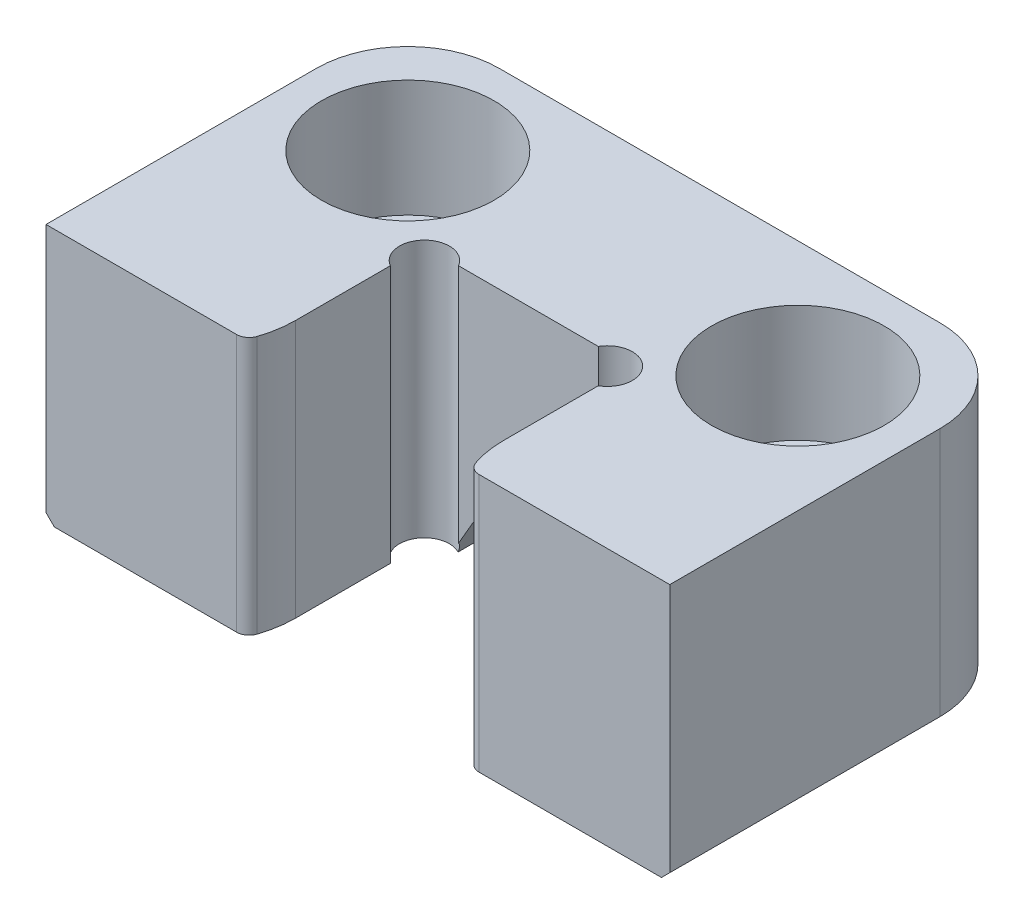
ISO-10303-21;
HEADER;
FILE_DESCRIPTION(('STEP AP214'),'2;1');
FILE_NAME('part.step','',(''),(''),'','','');
FILE_SCHEMA(('AUTOMOTIVE_DESIGN { 1 0 10303 214 1 1 1 1 }'));
ENDSEC;
DATA;
#1=APPLICATION_CONTEXT('core data for automotive mechanical design processes');
#2=APPLICATION_PROTOCOL_DEFINITION('international standard','automotive_design',2000,#1);
#3=PRODUCT_CONTEXT('',#1,'mechanical');
#4=PRODUCT('Part','Part','',(#3));
#5=PRODUCT_RELATED_PRODUCT_CATEGORY('part','',(#4));
#6=PRODUCT_DEFINITION_FORMATION('','',#4);
#7=PRODUCT_DEFINITION_CONTEXT('part definition',#1,'design');
#8=PRODUCT_DEFINITION('design','',#6,#7);
#9=PRODUCT_DEFINITION_SHAPE('','',#8);
#10=(LENGTH_UNIT() NAMED_UNIT(*) SI_UNIT(.MILLI.,.METRE.));
#11=(NAMED_UNIT(*) PLANE_ANGLE_UNIT() SI_UNIT($,.RADIAN.));
#12=(NAMED_UNIT(*) SI_UNIT($,.STERADIAN.) SOLID_ANGLE_UNIT());
#13=UNCERTAINTY_MEASURE_WITH_UNIT(LENGTH_MEASURE(1.E-05),#10,'distance_accuracy_value','');
#14=(GEOMETRIC_REPRESENTATION_CONTEXT(3) GLOBAL_UNCERTAINTY_ASSIGNED_CONTEXT((#13)) GLOBAL_UNIT_ASSIGNED_CONTEXT((#10,
#11,#12)) REPRESENTATION_CONTEXT('',''));
#15=CARTESIAN_POINT('',(0.,0.,0.));
#16=DIRECTION('',(0.,0.,1.));
#17=DIRECTION('',(1.,0.,0.));
#18=AXIS2_PLACEMENT_3D('',#15,#16,#17);
#19=CARTESIAN_POINT('',(-19.05,-15.748,-22.098));
#20=DIRECTION('',(0.,-1.,0.));
#21=DIRECTION('',(0.,0.,-1.));
#22=AXIS2_PLACEMENT_3D('',#19,#20,#21);
#23=PLANE('',#22);
#24=CARTESIAN_POINT('',(-11.9126,-15.748,-14.9606));
#25=DIRECTION('',(0.,1.,0.));
#26=DIRECTION('',(0.,0.,1.));
#27=AXIS2_PLACEMENT_3D('',#24,#25,#26);
#28=CIRCLE('',#27,3.2639);
#29=CARTESIAN_POINT('',(-11.9126,-15.748,-11.6967));
#30=VERTEX_POINT('',#29);
#31=EDGE_CURVE('E763',#30,#30,#28,.T.);
#32=ORIENTED_EDGE('',*,*,#31,.T.);
#33=EDGE_LOOP('',(#32));
#34=FACE_BOUND('',#33,.T.);
#35=CARTESIAN_POINT('',(-12.7,-15.748,-2.54));
#36=DIRECTION('',(0.,-1.,0.));
#37=DIRECTION('',(0.,0.,1.));
#38=AXIS2_PLACEMENT_3D('',#35,#36,#37);
#39=CIRCLE('',#38,6.35);
#40=CARTESIAN_POINT('',(-6.35,-15.748,-2.54));
#41=VERTEX_POINT('',#40);
#42=CARTESIAN_POINT('',(-6.68001134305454,-15.748,-0.519545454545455));
#43=VERTEX_POINT('',#42);
#44=EDGE_CURVE('E261',#41,#43,#39,.T.);
#45=ORIENTED_EDGE('',*,*,#44,.T.);
#46=CARTESIAN_POINT('',(-7.402409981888,-15.748,-0.762));
#47=DIRECTION('',(0.,-1.,0.));
#48=DIRECTION('',(0.,0.,-1.));
#49=AXIS2_PLACEMENT_3D('',#46,#47,#48);
#50=CIRCLE('',#49,0.762);
#51=CARTESIAN_POINT('',(-7.402409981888,-15.748,0.));
#52=VERTEX_POINT('',#51);
#53=EDGE_CURVE('E11',#43,#52,#50,.T.);
#54=ORIENTED_EDGE('',*,*,#53,.T.);
#55=DIRECTION('',(1.,0.,0.));
#56=VECTOR('',#55,1.);
#57=CARTESIAN_POINT('',(-19.05,-15.748,0.));
#58=LINE('',#57,#56);
#59=CARTESIAN_POINT('',(-18.542,-15.748,0.));
#60=VERTEX_POINT('',#59);
#61=EDGE_CURVE('E274',#60,#52,#58,.T.);
#62=ORIENTED_EDGE('',*,*,#61,.F.);
#63=DIRECTION('',(0.,0.,-1.));
#64=VECTOR('',#63,1.);
#65=CARTESIAN_POINT('',(-18.542,-15.748,-22.098));
#66=LINE('',#65,#64);
#67=CARTESIAN_POINT('',(-18.542,-15.748,-16.51));
#68=VERTEX_POINT('',#67);
#69=EDGE_CURVE('E353',#60,#68,#66,.T.);
#70=ORIENTED_EDGE('',*,*,#69,.T.);
#71=CARTESIAN_POINT('',(-13.462,-15.748,-16.51));
#72=DIRECTION('',(0.,-1.,0.));
#73=DIRECTION('',(0.,0.,-1.));
#74=AXIS2_PLACEMENT_3D('',#71,#72,#73);
#75=CIRCLE('',#74,5.08);
#76=CARTESIAN_POINT('',(-13.462,-15.748,-21.59));
#77=VERTEX_POINT('',#76);
#78=EDGE_CURVE('E355',#68,#77,#75,.T.);
#79=ORIENTED_EDGE('',*,*,#78,.T.);
#80=DIRECTION('',(1.,0.,0.));
#81=VECTOR('',#80,1.);
#82=CARTESIAN_POINT('',(-19.05,-15.748,-21.59));
#83=LINE('',#82,#81);
#84=CARTESIAN_POINT('',(-4.88529355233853,-15.748,-21.59));
#85=VERTEX_POINT('',#84);
#86=EDGE_CURVE('E357',#77,#85,#83,.T.);
#87=ORIENTED_EDGE('',*,*,#86,.T.);
#88=DIRECTION('',(0.,0.,-1.));
#89=VECTOR('',#88,1.);
#90=CARTESIAN_POINT('',(-4.88529355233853,-15.748,0.));
#91=LINE('',#90,#89);
#92=CARTESIAN_POINT('',(-4.88529355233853,-15.748,-11.0043237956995));
#93=VERTEX_POINT('',#92);
#94=EDGE_CURVE('E233',#93,#85,#91,.T.);
#95=ORIENTED_EDGE('',*,*,#94,.F.);
#96=CARTESIAN_POINT('',(-5.588,-15.748,-9.652));
#97=DIRECTION('',(0.,1.,0.));
#98=DIRECTION('',(0.,0.,1.));
#99=AXIS2_PLACEMENT_3D('',#96,#97,#98);
#100=CIRCLE('',#99,1.524);
#101=CARTESIAN_POINT('',(-6.35,-15.748,-8.33217728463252));
#102=VERTEX_POINT('',#101);
#103=EDGE_CURVE('E252',#93,#102,#100,.T.);
#104=ORIENTED_EDGE('',*,*,#103,.T.);
#105=DIRECTION('',(0.,0.,-1.));
#106=VECTOR('',#105,1.);
#107=CARTESIAN_POINT('',(-6.35,-15.748,0.));
#108=LINE('',#107,#106);
#109=EDGE_CURVE('E276',#41,#102,#108,.T.);
#110=ORIENTED_EDGE('',*,*,#109,.F.);
#111=EDGE_LOOP('',(#45,#54,#62,#70,#79,#87,#95,#104,#110));
#112=FACE_BOUND('',#111,.T.);
#113=ADVANCED_FACE('F34',(#34,#112),#23,.T.);
#114=CARTESIAN_POINT('',(-19.05,-15.748,0.));
#115=DIRECTION('',(-1.,0.,0.));
#116=DIRECTION('',(0.,0.,1.));
#117=AXIS2_PLACEMENT_3D('',#114,#115,#116);
#118=PLANE('',#117);
#119=DIRECTION('',(0.,1.,0.));
#120=VECTOR('',#119,1.);
#121=CARTESIAN_POINT('',(-19.05,-15.748,-16.51));
#122=LINE('',#121,#120);
#123=CARTESIAN_POINT('',(-19.05,0.,-16.51));
#124=VERTEX_POINT('',#123);
#125=CARTESIAN_POINT('',(-19.05,-15.24,-16.51));
#126=VERTEX_POINT('',#125);
#127=EDGE_CURVE('E321',#124,#126,#122,.F.);
#128=ORIENTED_EDGE('',*,*,#127,.T.);
#129=DIRECTION('',(0.,0.,1.));
#130=VECTOR('',#129,1.);
#131=CARTESIAN_POINT('',(-19.05,-15.24,0.));
#132=LINE('',#131,#130);
#133=CARTESIAN_POINT('',(-19.05,-15.24,0.));
#134=VERTEX_POINT('',#133);
#135=EDGE_CURVE('E362',#126,#134,#132,.T.);
#136=ORIENTED_EDGE('',*,*,#135,.T.);
#137=DIRECTION('',(0.,1.,0.));
#138=VECTOR('',#137,1.);
#139=CARTESIAN_POINT('',(-19.05,-15.748,0.));
#140=LINE('',#139,#138);
#141=CARTESIAN_POINT('',(-19.05,0.,0.));
#142=VERTEX_POINT('',#141);
#143=EDGE_CURVE('E285',#134,#142,#140,.T.);
#144=ORIENTED_EDGE('',*,*,#143,.T.);
#145=DIRECTION('',(0.,0.,1.));
#146=VECTOR('',#145,1.);
#147=CARTESIAN_POINT('',(-19.05,0.,0.));
#148=LINE('',#147,#146);
#149=EDGE_CURVE('E271',#124,#142,#148,.T.);
#150=ORIENTED_EDGE('',*,*,#149,.F.);
#151=EDGE_LOOP('',(#128,#136,#144,#150));
#152=FACE_BOUND('',#151,.T.);
#153=ADVANCED_FACE('F411',(#152),#118,.T.);
#154=CARTESIAN_POINT('',(-19.05,-15.748,-22.098));
#155=DIRECTION('',(0.,0.,-1.));
#156=DIRECTION('',(-1.,0.,0.));
#157=AXIS2_PLACEMENT_3D('',#154,#155,#156);
#158=PLANE('',#157);
#159=DIRECTION('',(0.,1.,0.));
#160=VECTOR('',#159,1.);
#161=CARTESIAN_POINT('',(13.462,-15.748,-22.098));
#162=LINE('',#161,#160);
#163=CARTESIAN_POINT('',(13.462,0.,-22.098));
#164=VERTEX_POINT('',#163);
#165=CARTESIAN_POINT('',(13.462,-15.24,-22.098));
#166=VERTEX_POINT('',#165);
#167=EDGE_CURVE('E319',#164,#166,#162,.F.);
#168=ORIENTED_EDGE('',*,*,#167,.T.);
#169=DIRECTION('',(-1.,0.,0.));
#170=VECTOR('',#169,1.);
#171=CARTESIAN_POINT('',(-19.05,-15.24,-22.098));
#172=LINE('',#171,#170);
#173=CARTESIAN_POINT('',(4.5919996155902,-15.24,-22.098));
#174=VERTEX_POINT('',#173);
#175=EDGE_CURVE('E349',#166,#174,#172,.T.);
#176=ORIENTED_EDGE('',*,*,#175,.T.);
#177=DIRECTION('',(0.499999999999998,-0.86602540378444,0.));
#178=VECTOR('',#177,1.);
#179=CARTESIAN_POINT('',(3.96875,-14.1605,-22.098));
#180=LINE('',#179,#178);
#181=CARTESIAN_POINT('',(3.96875,-14.1605,-22.098));
#182=VERTEX_POINT('',#181);
#183=EDGE_CURVE('E213',#182,#174,#180,.T.);
#184=ORIENTED_EDGE('',*,*,#183,.F.);
#185=DIRECTION('',(1.,0.,0.));
#186=VECTOR('',#185,1.);
#187=CARTESIAN_POINT('',(3.96875,-14.1605,-22.098));
#188=LINE('',#187,#186);
#189=CARTESIAN_POINT('',(-3.96875,-14.1605,-22.098));
#190=VERTEX_POINT('',#189);
#191=EDGE_CURVE('E206',#190,#182,#188,.T.);
#192=ORIENTED_EDGE('',*,*,#191,.F.);
#193=DIRECTION('',(0.499999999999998,0.86602540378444,0.));
#194=VECTOR('',#193,1.);
#195=CARTESIAN_POINT('',(-3.96875,-14.1605,-22.098));
#196=LINE('',#195,#194);
#197=CARTESIAN_POINT('',(-4.5919996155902,-15.24,-22.098));
#198=VERTEX_POINT('',#197);
#199=EDGE_CURVE('E216',#198,#190,#196,.T.);
#200=ORIENTED_EDGE('',*,*,#199,.F.);
#201=DIRECTION('',(-1.,0.,0.));
#202=VECTOR('',#201,1.);
#203=CARTESIAN_POINT('',(-19.05,-15.24,-22.098));
#204=LINE('',#203,#202);
#205=CARTESIAN_POINT('',(-13.462,-15.24,-22.098));
#206=VERTEX_POINT('',#205);
#207=EDGE_CURVE('E347',#198,#206,#204,.T.);
#208=ORIENTED_EDGE('',*,*,#207,.T.);
#209=DIRECTION('',(0.,1.,0.));
#210=VECTOR('',#209,1.);
#211=CARTESIAN_POINT('',(-13.462,-15.748,-22.098));
#212=LINE('',#211,#210);
#213=CARTESIAN_POINT('',(-13.462,0.,-22.098));
#214=VERTEX_POINT('',#213);
#215=EDGE_CURVE('E317',#206,#214,#212,.T.);
#216=ORIENTED_EDGE('',*,*,#215,.T.);
#217=DIRECTION('',(-1.,0.,0.));
#218=VECTOR('',#217,1.);
#219=CARTESIAN_POINT('',(-19.05,0.,-22.098));
#220=LINE('',#219,#218);
#221=EDGE_CURVE('E277',#164,#214,#220,.T.);
#222=ORIENTED_EDGE('',*,*,#221,.F.);
#223=EDGE_LOOP('',(#168,#176,#184,#192,#200,#208,#216,#222));
#224=FACE_BOUND('',#223,.T.);
#225=ADVANCED_FACE('F227',(#224),#158,.T.);
#226=CARTESIAN_POINT('',(19.05,-15.748,0.));
#227=DIRECTION('',(1.,0.,0.));
#228=DIRECTION('',(0.,0.,-1.));
#229=AXIS2_PLACEMENT_3D('',#226,#227,#228);
#230=PLANE('',#229);
#231=DIRECTION('',(0.,1.,0.));
#232=VECTOR('',#231,1.);
#233=CARTESIAN_POINT('',(19.05,-15.748,0.));
#234=LINE('',#233,#232);
#235=CARTESIAN_POINT('',(19.05,-15.24,0.));
#236=VERTEX_POINT('',#235);
#237=CARTESIAN_POINT('',(19.05,0.,0.));
#238=VERTEX_POINT('',#237);
#239=EDGE_CURVE('E307',#236,#238,#234,.T.);
#240=ORIENTED_EDGE('',*,*,#239,.F.);
#241=DIRECTION('',(0.,0.,-1.));
#242=VECTOR('',#241,1.);
#243=CARTESIAN_POINT('',(19.05,-15.24,0.));
#244=LINE('',#243,#242);
#245=CARTESIAN_POINT('',(19.05,-15.24,-16.51));
#246=VERTEX_POINT('',#245);
#247=EDGE_CURVE('E333',#236,#246,#244,.T.);
#248=ORIENTED_EDGE('',*,*,#247,.T.);
#249=DIRECTION('',(0.,1.,0.));
#250=VECTOR('',#249,1.);
#251=CARTESIAN_POINT('',(19.05,-15.748,-16.51));
#252=LINE('',#251,#250);
#253=CARTESIAN_POINT('',(19.05,0.,-16.51));
#254=VERTEX_POINT('',#253);
#255=EDGE_CURVE('E310',#246,#254,#252,.T.);
#256=ORIENTED_EDGE('',*,*,#255,.T.);
#257=DIRECTION('',(0.,0.,-1.));
#258=VECTOR('',#257,1.);
#259=CARTESIAN_POINT('',(19.05,0.,0.));
#260=LINE('',#259,#258);
#261=EDGE_CURVE('E302',#238,#254,#260,.T.);
#262=ORIENTED_EDGE('',*,*,#261,.F.);
#263=EDGE_LOOP('',(#240,#248,#256,#262));
#264=FACE_BOUND('',#263,.T.);
#265=ADVANCED_FACE('F517',(#264),#230,.T.);
#266=CARTESIAN_POINT('',(6.35,-15.748,0.));
#267=DIRECTION('',(0.,0.,1.));
#268=DIRECTION('',(1.,0.,0.));
#269=AXIS2_PLACEMENT_3D('',#266,#267,#268);
#270=PLANE('',#269);
#271=DIRECTION('',(1.,0.,0.));
#272=VECTOR('',#271,1.);
#273=CARTESIAN_POINT('',(6.35,0.,0.));
#274=LINE('',#273,#272);
#275=CARTESIAN_POINT('',(7.402409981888,0.,0.));
#276=VERTEX_POINT('',#275);
#277=EDGE_CURVE('E300',#276,#238,#274,.T.);
#278=ORIENTED_EDGE('',*,*,#277,.F.);
#279=DIRECTION('',(0.,-1.,0.));
#280=VECTOR('',#279,1.);
#281=CARTESIAN_POINT('',(7.402409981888,-15.748,0.));
#282=LINE('',#281,#280);
#283=CARTESIAN_POINT('',(7.402409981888,-15.748,0.));
#284=VERTEX_POINT('',#283);
#285=EDGE_CURVE('E391',#276,#284,#282,.T.);
#286=ORIENTED_EDGE('',*,*,#285,.T.);
#287=DIRECTION('',(1.,0.,0.));
#288=VECTOR('',#287,1.);
#289=CARTESIAN_POINT('',(6.35,-15.748,0.));
#290=LINE('',#289,#288);
#291=CARTESIAN_POINT('',(18.542,-15.748,0.));
#292=VERTEX_POINT('',#291);
#293=EDGE_CURVE('E283',#284,#292,#290,.T.);
#294=ORIENTED_EDGE('',*,*,#293,.T.);
#295=DIRECTION('',(-0.707106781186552,-0.707106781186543,0.));
#296=VECTOR('',#295,1.);
#297=CARTESIAN_POINT('',(12.4459999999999,-21.844,0.));
#298=LINE('',#297,#296);
#299=EDGE_CURVE('E343',#292,#236,#298,.F.);
#300=ORIENTED_EDGE('',*,*,#299,.T.);
#301=ORIENTED_EDGE('',*,*,#239,.T.);
#302=EDGE_LOOP('',(#278,#286,#294,#300,#301));
#303=FACE_BOUND('',#302,.T.);
#304=ADVANCED_FACE('F520',(#303),#270,.T.);
#305=CARTESIAN_POINT('',(6.35,-15.748,0.));
#306=DIRECTION('',(-1.,0.,0.));
#307=DIRECTION('',(0.,0.,1.));
#308=AXIS2_PLACEMENT_3D('',#305,#306,#307);
#309=PLANE('',#308);
#310=DIRECTION('',(0.,1.,0.));
#311=VECTOR('',#310,1.);
#312=CARTESIAN_POINT('',(6.35,-15.748,-8.33217728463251));
#313=LINE('',#312,#311);
#314=CARTESIAN_POINT('',(6.35,-15.748,-8.33217728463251));
#315=VERTEX_POINT('',#314);
#316=CARTESIAN_POINT('',(6.35,0.,-8.33217728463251));
#317=VERTEX_POINT('',#316);
#318=EDGE_CURVE('E249',#315,#317,#313,.T.);
#319=ORIENTED_EDGE('',*,*,#318,.F.);
#320=DIRECTION('',(0.,0.,1.));
#321=VECTOR('',#320,1.);
#322=CARTESIAN_POINT('',(6.35,-15.748,0.));
#323=LINE('',#322,#321);
#324=CARTESIAN_POINT('',(6.35,-15.748,-2.54));
#325=VERTEX_POINT('',#324);
#326=EDGE_CURVE('E280',#315,#325,#323,.T.);
#327=ORIENTED_EDGE('',*,*,#326,.T.);
#328=DIRECTION('',(0.,1.,0.));
#329=VECTOR('',#328,1.);
#330=CARTESIAN_POINT('',(6.35,-15.748,-2.54));
#331=LINE('',#330,#329);
#332=CARTESIAN_POINT('',(6.35,0.,-2.54));
#333=VERTEX_POINT('',#332);
#334=EDGE_CURVE('E266',#325,#333,#331,.T.);
#335=ORIENTED_EDGE('',*,*,#334,.T.);
#336=DIRECTION('',(0.,0.,1.));
#337=VECTOR('',#336,1.);
#338=CARTESIAN_POINT('',(6.35,0.,0.));
#339=LINE('',#338,#337);
#340=EDGE_CURVE('E297',#317,#333,#339,.T.);
#341=ORIENTED_EDGE('',*,*,#340,.F.);
#342=EDGE_LOOP('',(#319,#327,#335,#341));
#343=FACE_BOUND('',#342,.T.);
#344=ADVANCED_FACE('F488',(#343),#309,.T.);
#345=CARTESIAN_POINT('',(-6.35,-15.748,-10.414));
#346=DIRECTION('',(0.,0.,1.));
#347=DIRECTION('',(1.,0.,0.));
#348=AXIS2_PLACEMENT_3D('',#345,#346,#347);
#349=PLANE('',#348);
#350=DIRECTION('',(-0.499999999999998,-0.86602540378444,0.));
#351=VECTOR('',#350,1.);
#352=CARTESIAN_POINT('',(-5.25147016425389,-16.3822364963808,-10.414));
#353=LINE('',#352,#351);
#354=CARTESIAN_POINT('',(-3.37934094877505,-13.1396135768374,-10.414));
#355=VERTEX_POINT('',#354);
#356=CARTESIAN_POINT('',(-4.26817728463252,-14.6791232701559,-10.414));
#357=VERTEX_POINT('',#356);
#358=EDGE_CURVE('E241',#355,#357,#353,.T.);
#359=ORIENTED_EDGE('',*,*,#358,.F.);
#360=DIRECTION('',(1.,0.,0.));
#361=VECTOR('',#360,1.);
#362=CARTESIAN_POINT('',(3.96875,-13.1396135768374,-10.414));
#363=LINE('',#362,#361);
#364=CARTESIAN_POINT('',(3.37934094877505,-13.1396135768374,-10.414));
#365=VERTEX_POINT('',#364);
#366=EDGE_CURVE('E377',#355,#365,#363,.T.);
#367=ORIENTED_EDGE('',*,*,#366,.T.);
#368=DIRECTION('',(-0.499999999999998,0.86602540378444,0.));
#369=VECTOR('',#368,1.);
#370=CARTESIAN_POINT('',(2.07647016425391,-10.8829751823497,-10.414));
#371=LINE('',#370,#369);
#372=CARTESIAN_POINT('',(4.26817728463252,-14.6791232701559,-10.414));
#373=VERTEX_POINT('',#372);
#374=EDGE_CURVE('E235',#373,#365,#371,.T.);
#375=ORIENTED_EDGE('',*,*,#374,.F.);
#376=DIRECTION('',(0.,1.,0.));
#377=VECTOR('',#376,1.);
#378=CARTESIAN_POINT('',(4.26817728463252,-15.748,-10.414));
#379=LINE('',#378,#377);
#380=CARTESIAN_POINT('',(4.26817728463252,0.,-10.414));
#381=VERTEX_POINT('',#380);
#382=EDGE_CURVE('E246',#381,#373,#379,.F.);
#383=ORIENTED_EDGE('',*,*,#382,.F.);
#384=DIRECTION('',(1.,0.,0.));
#385=VECTOR('',#384,1.);
#386=CARTESIAN_POINT('',(-6.35,0.,-10.414));
#387=LINE('',#386,#385);
#388=CARTESIAN_POINT('',(-4.26817728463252,0.,-10.414));
#389=VERTEX_POINT('',#388);
#390=EDGE_CURVE('E294',#389,#381,#387,.T.);
#391=ORIENTED_EDGE('',*,*,#390,.F.);
#392=DIRECTION('',(0.,1.,0.));
#393=VECTOR('',#392,1.);
#394=CARTESIAN_POINT('',(-4.26817728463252,-15.748,-10.414));
#395=LINE('',#394,#393);
#396=EDGE_CURVE('E258',#357,#389,#395,.T.);
#397=ORIENTED_EDGE('',*,*,#396,.F.);
#398=EDGE_LOOP('',(#359,#367,#375,#383,#391,#397));
#399=FACE_BOUND('',#398,.T.);
#400=ADVANCED_FACE('F434',(#399),#349,.T.);
#401=CARTESIAN_POINT('',(-6.35,-15.748,0.));
#402=DIRECTION('',(1.,0.,0.));
#403=DIRECTION('',(0.,0.,-1.));
#404=AXIS2_PLACEMENT_3D('',#401,#402,#403);
#405=PLANE('',#404);
#406=DIRECTION('',(0.,1.,0.));
#407=VECTOR('',#406,1.);
#408=CARTESIAN_POINT('',(-6.35,-15.748,-8.33217728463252));
#409=LINE('',#408,#407);
#410=CARTESIAN_POINT('',(-6.35,0.,-8.33217728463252));
#411=VERTEX_POINT('',#410);
#412=EDGE_CURVE('E254',#411,#102,#409,.F.);
#413=ORIENTED_EDGE('',*,*,#412,.F.);
#414=DIRECTION('',(0.,0.,-1.));
#415=VECTOR('',#414,1.);
#416=CARTESIAN_POINT('',(-6.35,0.,0.));
#417=LINE('',#416,#415);
#418=CARTESIAN_POINT('',(-6.35,0.,-2.54));
#419=VERTEX_POINT('',#418);
#420=EDGE_CURVE('E291',#419,#411,#417,.T.);
#421=ORIENTED_EDGE('',*,*,#420,.F.);
#422=DIRECTION('',(0.,1.,0.));
#423=VECTOR('',#422,1.);
#424=CARTESIAN_POINT('',(-6.35,-15.748,-2.54));
#425=LINE('',#424,#423);
#426=EDGE_CURVE('E269',#41,#419,#425,.T.);
#427=ORIENTED_EDGE('',*,*,#426,.F.);
#428=ORIENTED_EDGE('',*,*,#109,.T.);
#429=EDGE_LOOP('',(#413,#421,#427,#428));
#430=FACE_BOUND('',#429,.T.);
#431=ADVANCED_FACE('F441',(#430),#405,.T.);
#432=CARTESIAN_POINT('',(-19.05,-15.748,0.));
#433=DIRECTION('',(0.,0.,1.));
#434=DIRECTION('',(1.,0.,0.));
#435=AXIS2_PLACEMENT_3D('',#432,#433,#434);
#436=PLANE('',#435);
#437=ORIENTED_EDGE('',*,*,#61,.T.);
#438=DIRECTION('',(0.,-1.,0.));
#439=VECTOR('',#438,1.);
#440=CARTESIAN_POINT('',(-7.402409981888,0.,0.));
#441=LINE('',#440,#439);
#442=CARTESIAN_POINT('',(-7.402409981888,0.,0.));
#443=VERTEX_POINT('',#442);
#444=EDGE_CURVE('E395',#52,#443,#441,.F.);
#445=ORIENTED_EDGE('',*,*,#444,.T.);
#446=DIRECTION('',(1.,0.,0.));
#447=VECTOR('',#446,1.);
#448=CARTESIAN_POINT('',(-19.05,0.,0.));
#449=LINE('',#448,#447);
#450=EDGE_CURVE('E288',#142,#443,#449,.T.);
#451=ORIENTED_EDGE('',*,*,#450,.F.);
#452=ORIENTED_EDGE('',*,*,#143,.F.);
#453=DIRECTION('',(-0.707106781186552,0.707106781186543,0.));
#454=VECTOR('',#453,1.);
#455=CARTESIAN_POINT('',(-18.796,-15.494,0.));
#456=LINE('',#455,#454);
#457=EDGE_CURVE('E364',#134,#60,#456,.F.);
#458=ORIENTED_EDGE('',*,*,#457,.T.);
#459=EDGE_LOOP('',(#437,#445,#451,#452,#458));
#460=FACE_BOUND('',#459,.T.);
#461=ADVANCED_FACE('F400',(#460),#436,.T.);
#462=CARTESIAN_POINT('',(11.9126,-15.748,-14.9606));
#463=DIRECTION('',(0.,1.,0.));
#464=DIRECTION('',(0.,0.,1.));
#465=AXIS2_PLACEMENT_3D('',#462,#463,#464);
#466=CIRCLE('',#465,3.2639);
#467=CARTESIAN_POINT('',(11.9126,-15.748,-11.6967));
#468=VERTEX_POINT('',#467);
#469=EDGE_CURVE('E373',#468,#468,#466,.T.);
#470=ORIENTED_EDGE('',*,*,#469,.T.);
#471=EDGE_LOOP('',(#470));
#472=FACE_BOUND('',#471,.T.);
#473=ORIENTED_EDGE('',*,*,#293,.F.);
#474=CARTESIAN_POINT('',(7.402409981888,-15.748,-0.762));
#475=DIRECTION('',(0.,-1.,0.));
#476=DIRECTION('',(0.,0.,-1.));
#477=AXIS2_PLACEMENT_3D('',#474,#475,#476);
#478=CIRCLE('',#477,0.762);
#479=CARTESIAN_POINT('',(6.68001134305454,-15.748,-0.519545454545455));
#480=VERTEX_POINT('',#479);
#481=EDGE_CURVE('E393',#284,#480,#478,.T.);
#482=ORIENTED_EDGE('',*,*,#481,.T.);
#483=CARTESIAN_POINT('',(12.7,-15.748,-2.54));
#484=DIRECTION('',(0.,-1.,0.));
#485=DIRECTION('',(0.,0.,-1.));
#486=AXIS2_PLACEMENT_3D('',#483,#484,#485);
#487=CIRCLE('',#486,6.35);
#488=EDGE_CURVE('E263',#480,#325,#487,.T.);
#489=ORIENTED_EDGE('',*,*,#488,.T.);
#490=ORIENTED_EDGE('',*,*,#326,.F.);
#491=CARTESIAN_POINT('',(5.588,-15.748,-9.652));
#492=DIRECTION('',(0.,1.,0.));
#493=DIRECTION('',(0.,0.,-1.));
#494=AXIS2_PLACEMENT_3D('',#491,#492,#493);
#495=CIRCLE('',#494,1.524);
#496=CARTESIAN_POINT('',(4.88529355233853,-15.748,-11.0043237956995));
#497=VERTEX_POINT('',#496);
#498=EDGE_CURVE('E243',#315,#497,#495,.T.);
#499=ORIENTED_EDGE('',*,*,#498,.T.);
#500=DIRECTION('',(0.,0.,-1.));
#501=VECTOR('',#500,1.);
#502=CARTESIAN_POINT('',(4.88529355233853,-15.748,0.));
#503=LINE('',#502,#501);
#504=CARTESIAN_POINT('',(4.88529355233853,-15.748,-21.59));
#505=VERTEX_POINT('',#504);
#506=EDGE_CURVE('E236',#497,#505,#503,.T.);
#507=ORIENTED_EDGE('',*,*,#506,.T.);
#508=DIRECTION('',(1.,0.,0.));
#509=VECTOR('',#508,1.);
#510=CARTESIAN_POINT('',(-19.05,-15.748,-21.59));
#511=LINE('',#510,#509);
#512=CARTESIAN_POINT('',(13.462,-15.748,-21.59));
#513=VERTEX_POINT('',#512);
#514=EDGE_CURVE('E336',#505,#513,#511,.T.);
#515=ORIENTED_EDGE('',*,*,#514,.T.);
#516=CARTESIAN_POINT('',(13.462,-15.748,-16.51));
#517=DIRECTION('',(0.,-1.,0.));
#518=DIRECTION('',(0.,0.,-1.));
#519=AXIS2_PLACEMENT_3D('',#516,#517,#518);
#520=CIRCLE('',#519,5.08);
#521=CARTESIAN_POINT('',(18.542,-15.748,-16.51));
#522=VERTEX_POINT('',#521);
#523=EDGE_CURVE('E338',#513,#522,#520,.T.);
#524=ORIENTED_EDGE('',*,*,#523,.T.);
#525=DIRECTION('',(0.,0.,1.));
#526=VECTOR('',#525,1.);
#527=CARTESIAN_POINT('',(18.542,-15.748,-22.098));
#528=LINE('',#527,#526);
#529=EDGE_CURVE('E340',#522,#292,#528,.T.);
#530=ORIENTED_EDGE('',*,*,#529,.T.);
#531=EDGE_LOOP('',(#473,#482,#489,#490,#499,#507,#515,#524,#530));
#532=FACE_BOUND('',#531,.T.);
#533=ADVANCED_FACE('F454',(#472,#532),#23,.T.);
#534=CARTESIAN_POINT('',(-19.05,0.,-22.098));
#535=DIRECTION('',(0.,-1.,0.));
#536=DIRECTION('',(0.,0.,-1.));
#537=AXIS2_PLACEMENT_3D('',#534,#535,#536);
#538=PLANE('',#537);
#539=CARTESIAN_POINT('',(-11.9126,0.,-14.9606));
#540=DIRECTION('',(0.,1.,0.));
#541=DIRECTION('',(0.,0.,1.));
#542=AXIS2_PLACEMENT_3D('',#539,#540,#541);
#543=CIRCLE('',#542,5.2705);
#544=CARTESIAN_POINT('',(-11.9126,0.,-9.6901));
#545=VERTEX_POINT('',#544);
#546=EDGE_CURVE('E779',#545,#545,#543,.T.);
#547=ORIENTED_EDGE('',*,*,#546,.F.);
#548=EDGE_LOOP('',(#547));
#549=FACE_BOUND('',#548,.T.);
#550=CARTESIAN_POINT('',(11.9126,0.,-14.9606));
#551=DIRECTION('',(0.,1.,0.));
#552=DIRECTION('',(0.,0.,1.));
#553=AXIS2_PLACEMENT_3D('',#550,#551,#552);
#554=CIRCLE('',#553,5.2705);
#555=CARTESIAN_POINT('',(11.9126,0.,-9.6901));
#556=VERTEX_POINT('',#555);
#557=EDGE_CURVE('E761',#556,#556,#554,.T.);
#558=ORIENTED_EDGE('',*,*,#557,.F.);
#559=EDGE_LOOP('',(#558));
#560=FACE_BOUND('',#559,.T.);
#561=CARTESIAN_POINT('',(12.7,0.,-2.54));
#562=DIRECTION('',(0.,-1.,0.));
#563=DIRECTION('',(0.,0.,-1.));
#564=AXIS2_PLACEMENT_3D('',#561,#562,#563);
#565=CIRCLE('',#564,6.35);
#566=CARTESIAN_POINT('',(6.68001134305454,0.,-0.519545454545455));
#567=VERTEX_POINT('',#566);
#568=EDGE_CURVE('E264',#567,#333,#565,.T.);
#569=ORIENTED_EDGE('',*,*,#568,.F.);
#570=CARTESIAN_POINT('',(7.402409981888,0.,-0.762));
#571=DIRECTION('',(0.,-1.,0.));
#572=DIRECTION('',(0.,0.,-1.));
#573=AXIS2_PLACEMENT_3D('',#570,#571,#572);
#574=CIRCLE('',#573,0.762);
#575=EDGE_CURVE('E389',#567,#276,#574,.F.);
#576=ORIENTED_EDGE('',*,*,#575,.T.);
#577=ORIENTED_EDGE('',*,*,#277,.T.);
#578=ORIENTED_EDGE('',*,*,#261,.T.);
#579=CARTESIAN_POINT('',(13.462,0.,-16.51));
#580=DIRECTION('',(0.,-1.,0.));
#581=DIRECTION('',(0.,0.,-1.));
#582=AXIS2_PLACEMENT_3D('',#579,#580,#581);
#583=CIRCLE('',#582,5.588);
#584=EDGE_CURVE('E315',#254,#164,#583,.F.);
#585=ORIENTED_EDGE('',*,*,#584,.T.);
#586=ORIENTED_EDGE('',*,*,#221,.T.);
#587=CARTESIAN_POINT('',(-13.462,0.,-16.51));
#588=DIRECTION('',(0.,-1.,0.));
#589=DIRECTION('',(0.,0.,-1.));
#590=AXIS2_PLACEMENT_3D('',#587,#588,#589);
#591=CIRCLE('',#590,5.588);
#592=EDGE_CURVE('E313',#214,#124,#591,.F.);
#593=ORIENTED_EDGE('',*,*,#592,.T.);
#594=ORIENTED_EDGE('',*,*,#149,.T.);
#595=ORIENTED_EDGE('',*,*,#450,.T.);
#596=CARTESIAN_POINT('',(-7.402409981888,0.,-0.762));
#597=DIRECTION('',(0.,-1.,0.));
#598=DIRECTION('',(0.,0.,-1.));
#599=AXIS2_PLACEMENT_3D('',#596,#597,#598);
#600=CIRCLE('',#599,0.762);
#601=CARTESIAN_POINT('',(-6.68001134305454,0.,-0.519545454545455));
#602=VERTEX_POINT('',#601);
#603=EDGE_CURVE('E387',#443,#602,#600,.F.);
#604=ORIENTED_EDGE('',*,*,#603,.T.);
#605=CARTESIAN_POINT('',(-12.7,0.,-2.54));
#606=DIRECTION('',(0.,-1.,0.));
#607=DIRECTION('',(0.,0.,1.));
#608=AXIS2_PLACEMENT_3D('',#605,#606,#607);
#609=CIRCLE('',#608,6.35);
#610=EDGE_CURVE('E260',#419,#602,#609,.T.);
#611=ORIENTED_EDGE('',*,*,#610,.F.);
#612=ORIENTED_EDGE('',*,*,#420,.T.);
#613=CARTESIAN_POINT('',(-5.588,0.,-9.652));
#614=DIRECTION('',(0.,1.,0.));
#615=DIRECTION('',(0.,0.,1.));
#616=AXIS2_PLACEMENT_3D('',#613,#614,#615);
#617=CIRCLE('',#616,1.524);
#618=EDGE_CURVE('E251',#389,#411,#617,.T.);
#619=ORIENTED_EDGE('',*,*,#618,.F.);
#620=ORIENTED_EDGE('',*,*,#390,.T.);
#621=CARTESIAN_POINT('',(5.588,0.,-9.652));
#622=DIRECTION('',(0.,-1.,0.));
#623=DIRECTION('',(0.,0.,-1.));
#624=AXIS2_PLACEMENT_3D('',#621,#622,#623);
#625=CIRCLE('',#624,1.524);
#626=EDGE_CURVE('E324',#381,#317,#625,.T.);
#627=ORIENTED_EDGE('',*,*,#626,.T.);
#628=ORIENTED_EDGE('',*,*,#340,.T.);
#629=EDGE_LOOP('',(#569,#576,#577,#578,#585,#586,#593,#594,#595,#604,#611,#612,#619,#620,#627,#628));
#630=FACE_BOUND('',#629,.T.);
#631=ADVANCED_FACE('F405',(#549,#560,#630),#538,.F.);
#632=CARTESIAN_POINT('',(13.462,-15.748,-16.51));
#633=DIRECTION('',(0.,1.,0.));
#634=DIRECTION('',(0.,0.,1.));
#635=AXIS2_PLACEMENT_3D('',#632,#633,#634);
#636=CYLINDRICAL_SURFACE('',#635,5.588);
#637=ORIENTED_EDGE('',*,*,#255,.F.);
#638=CARTESIAN_POINT('',(13.462,-15.24,-16.51));
#639=DIRECTION('',(0.,-1.,0.));
#640=DIRECTION('',(0.,0.,-1.));
#641=AXIS2_PLACEMENT_3D('',#638,#639,#640);
#642=CIRCLE('',#641,5.588);
#643=EDGE_CURVE('E345',#246,#166,#642,.F.);
#644=ORIENTED_EDGE('',*,*,#643,.T.);
#645=ORIENTED_EDGE('',*,*,#167,.F.);
#646=ORIENTED_EDGE('',*,*,#584,.F.);
#647=EDGE_LOOP('',(#637,#644,#645,#646));
#648=FACE_BOUND('',#647,.T.);
#649=ADVANCED_FACE('F468',(#648),#636,.T.);
#650=CARTESIAN_POINT('',(-13.462,-15.748,-16.51));
#651=DIRECTION('',(0.,1.,0.));
#652=DIRECTION('',(0.,0.,1.));
#653=AXIS2_PLACEMENT_3D('',#650,#651,#652);
#654=CYLINDRICAL_SURFACE('',#653,5.588);
#655=ORIENTED_EDGE('',*,*,#215,.F.);
#656=CARTESIAN_POINT('',(-13.462,-15.24,-16.51));
#657=DIRECTION('',(0.,-1.,0.));
#658=DIRECTION('',(0.,0.,-1.));
#659=AXIS2_PLACEMENT_3D('',#656,#657,#658);
#660=CIRCLE('',#659,5.588);
#661=EDGE_CURVE('E360',#206,#126,#660,.F.);
#662=ORIENTED_EDGE('',*,*,#661,.T.);
#663=ORIENTED_EDGE('',*,*,#127,.F.);
#664=ORIENTED_EDGE('',*,*,#592,.F.);
#665=EDGE_LOOP('',(#655,#662,#663,#664));
#666=FACE_BOUND('',#665,.T.);
#667=ADVANCED_FACE('F415',(#666),#654,.T.);
#668=CARTESIAN_POINT('',(12.7,-15.748,-2.54));
#669=DIRECTION('',(0.,1.,0.));
#670=DIRECTION('',(0.,0.,1.));
#671=AXIS2_PLACEMENT_3D('',#668,#669,#670);
#672=CYLINDRICAL_SURFACE('',#671,6.35);
#673=ORIENTED_EDGE('',*,*,#488,.F.);
#674=DIRECTION('',(0.,1.,0.));
#675=VECTOR('',#674,1.);
#676=CARTESIAN_POINT('',(6.68001134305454,-15.748,-0.519545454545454));
#677=LINE('',#676,#675);
#678=EDGE_CURVE('E384',#480,#567,#677,.T.);
#679=ORIENTED_EDGE('',*,*,#678,.T.);
#680=ORIENTED_EDGE('',*,*,#568,.T.);
#681=ORIENTED_EDGE('',*,*,#334,.F.);
#682=EDGE_LOOP('',(#673,#679,#680,#681));
#683=FACE_BOUND('',#682,.T.);
#684=ADVANCED_FACE('F483',(#683),#672,.T.);
#685=CARTESIAN_POINT('',(-12.7,-15.748,-2.54));
#686=DIRECTION('',(0.,1.,0.));
#687=DIRECTION('',(0.,0.,1.));
#688=AXIS2_PLACEMENT_3D('',#685,#686,#687);
#689=CYLINDRICAL_SURFACE('',#688,6.35);
#690=ORIENTED_EDGE('',*,*,#610,.T.);
#691=DIRECTION('',(0.,1.,0.));
#692=VECTOR('',#691,1.);
#693=CARTESIAN_POINT('',(-6.68001134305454,-15.748,-0.519545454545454));
#694=LINE('',#693,#692);
#695=EDGE_CURVE('E42',#602,#43,#694,.F.);
#696=ORIENTED_EDGE('',*,*,#695,.T.);
#697=ORIENTED_EDGE('',*,*,#44,.F.);
#698=ORIENTED_EDGE('',*,*,#426,.T.);
#699=EDGE_LOOP('',(#690,#696,#697,#698));
#700=FACE_BOUND('',#699,.T.);
#701=ADVANCED_FACE('F580',(#700),#689,.T.);
#702=CARTESIAN_POINT('',(-5.588,-15.748,-9.652));
#703=DIRECTION('',(0.,1.,0.));
#704=DIRECTION('',(0.,0.,1.));
#705=AXIS2_PLACEMENT_3D('',#702,#703,#704);
#706=CYLINDRICAL_SURFACE('',#705,1.524);
#707=ORIENTED_EDGE('',*,*,#103,.F.);
#708=CARTESIAN_POINT('',(-5.588,-16.9651232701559,-9.652));
#709=DIRECTION('',(-0.86602540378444,0.499999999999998,0.));
#710=DIRECTION('',(0.499999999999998,0.86602540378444,0.));
#711=AXIS2_PLACEMENT_3D('',#708,#709,#710);
#712=ELLIPSE('',#711,3.04800000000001,1.524);
#713=EDGE_CURVE('E330',#93,#357,#712,.F.);
#714=ORIENTED_EDGE('',*,*,#713,.T.);
#715=ORIENTED_EDGE('',*,*,#396,.T.);
#716=ORIENTED_EDGE('',*,*,#618,.T.);
#717=ORIENTED_EDGE('',*,*,#412,.T.);
#718=EDGE_LOOP('',(#707,#714,#715,#716,#717));
#719=FACE_BOUND('',#718,.T.);
#720=ADVANCED_FACE('F430',(#719),#706,.F.);
#721=CARTESIAN_POINT('',(5.588,-15.748,-9.652));
#722=DIRECTION('',(0.,1.,0.));
#723=DIRECTION('',(0.,0.,1.));
#724=AXIS2_PLACEMENT_3D('',#721,#722,#723);
#725=CYLINDRICAL_SURFACE('',#724,1.524);
#726=ORIENTED_EDGE('',*,*,#382,.T.);
#727=CARTESIAN_POINT('',(5.588,-16.9651232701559,-9.652));
#728=DIRECTION('',(0.86602540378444,0.499999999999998,0.));
#729=DIRECTION('',(-0.499999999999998,0.86602540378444,0.));
#730=AXIS2_PLACEMENT_3D('',#727,#728,#729);
#731=ELLIPSE('',#730,3.04800000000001,1.524);
#732=EDGE_CURVE('E327',#373,#497,#731,.F.);
#733=ORIENTED_EDGE('',*,*,#732,.T.);
#734=ORIENTED_EDGE('',*,*,#498,.F.);
#735=ORIENTED_EDGE('',*,*,#318,.T.);
#736=ORIENTED_EDGE('',*,*,#626,.F.);
#737=EDGE_LOOP('',(#726,#733,#734,#735,#736));
#738=FACE_BOUND('',#737,.T.);
#739=ADVANCED_FACE('F492',(#738),#725,.F.);
#740=CARTESIAN_POINT('',(-3.96875,-14.1605,0.));
#741=DIRECTION('',(-0.86602540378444,0.499999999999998,0.));
#742=DIRECTION('',(-0.499999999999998,-0.86602540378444,0.));
#743=AXIS2_PLACEMENT_3D('',#740,#741,#742);
#744=PLANE('',#743);
#745=ORIENTED_EDGE('',*,*,#94,.T.);
#746=DIRECTION('',(-0.377964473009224,-0.654653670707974,0.654653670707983));
#747=VECTOR('',#746,1.);
#748=CARTESIAN_POINT('',(-6.65742824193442,-18.8174273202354,-18.5205726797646));
#749=LINE('',#748,#747);
#750=EDGE_CURVE('E220',#85,#198,#749,.F.);
#751=ORIENTED_EDGE('',*,*,#750,.T.);
#752=ORIENTED_EDGE('',*,*,#199,.T.);
#753=DIRECTION('',(0.,0.,-1.));
#754=VECTOR('',#753,1.);
#755=CARTESIAN_POINT('',(-3.96875,-14.1605,0.));
#756=LINE('',#755,#754);
#757=CARTESIAN_POINT('',(-3.96875,-14.1605,-14.2240000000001));
#758=VERTEX_POINT('',#757);
#759=EDGE_CURVE('E201',#758,#190,#756,.T.);
#760=ORIENTED_EDGE('',*,*,#759,.F.);
#761=DIRECTION('',(0.147788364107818,0.255976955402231,0.955319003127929));
#762=VECTOR('',#761,1.);
#763=CARTESIAN_POINT('',(-1.96053409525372,-10.6821680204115,-1.24268832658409));
#764=LINE('',#763,#762);
#765=EDGE_CURVE('E380',#758,#355,#764,.T.);
#766=ORIENTED_EDGE('',*,*,#765,.T.);
#767=ORIENTED_EDGE('',*,*,#358,.T.);
#768=ORIENTED_EDGE('',*,*,#713,.F.);
#769=EDGE_LOOP('',(#745,#751,#752,#760,#766,#767,#768));
#770=FACE_BOUND('',#769,.T.);
#771=ADVANCED_FACE('F218',(#770),#744,.F.);
#772=CARTESIAN_POINT('',(3.96875,-14.1605,0.));
#773=DIRECTION('',(0.86602540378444,0.499999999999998,0.));
#774=DIRECTION('',(-0.499999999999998,0.86602540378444,0.));
#775=AXIS2_PLACEMENT_3D('',#772,#773,#774);
#776=PLANE('',#775);
#777=ORIENTED_EDGE('',*,*,#183,.T.);
#778=DIRECTION('',(-0.377964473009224,0.654653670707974,-0.654653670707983));
#779=VECTOR('',#778,1.);
#780=CARTESIAN_POINT('',(1.21457109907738,-9.39012221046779,-27.9478777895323));
#781=LINE('',#780,#779);
#782=EDGE_CURVE('E351',#174,#505,#781,.F.);
#783=ORIENTED_EDGE('',*,*,#782,.T.);
#784=ORIENTED_EDGE('',*,*,#506,.F.);
#785=ORIENTED_EDGE('',*,*,#732,.F.);
#786=ORIENTED_EDGE('',*,*,#374,.T.);
#787=DIRECTION('',(0.147788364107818,-0.255976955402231,-0.955319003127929));
#788=VECTOR('',#787,1.);
#789=CARTESIAN_POINT('',(1.96053409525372,-10.6821680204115,-1.24268832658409));
#790=LINE('',#789,#788);
#791=CARTESIAN_POINT('',(3.96875,-14.1605,-14.2240000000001));
#792=VERTEX_POINT('',#791);
#793=EDGE_CURVE('E382',#365,#792,#790,.T.);
#794=ORIENTED_EDGE('',*,*,#793,.T.);
#795=DIRECTION('',(0.,0.,-1.));
#796=VECTOR('',#795,1.);
#797=CARTESIAN_POINT('',(3.96875,-14.1605,0.));
#798=LINE('',#797,#796);
#799=EDGE_CURVE('E212',#792,#182,#798,.T.);
#800=ORIENTED_EDGE('',*,*,#799,.T.);
#801=EDGE_LOOP('',(#777,#783,#784,#785,#786,#794,#800));
#802=FACE_BOUND('',#801,.T.);
#803=ADVANCED_FACE('F494',(#802),#776,.F.);
#804=CARTESIAN_POINT('',(3.96875,-14.1605,0.));
#805=DIRECTION('',(0.,1.,0.));
#806=DIRECTION('',(0.,0.,1.));
#807=AXIS2_PLACEMENT_3D('',#804,#805,#806);
#808=PLANE('',#807);
#809=ORIENTED_EDGE('',*,*,#799,.F.);
#810=DIRECTION('',(-1.,0.,0.));
#811=VECTOR('',#810,1.);
#812=CARTESIAN_POINT('',(-3.96875,-14.1605,-14.2240000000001));
#813=LINE('',#812,#811);
#814=EDGE_CURVE('E209',#792,#758,#813,.T.);
#815=ORIENTED_EDGE('',*,*,#814,.T.);
#816=ORIENTED_EDGE('',*,*,#759,.T.);
#817=ORIENTED_EDGE('',*,*,#191,.T.);
#818=EDGE_LOOP('',(#809,#815,#816,#817));
#819=FACE_BOUND('',#818,.T.);
#820=ADVANCED_FACE('F204',(#819),#808,.F.);
#821=CARTESIAN_POINT('',(-19.05,-15.24,-22.098));
#822=DIRECTION('',(0.,0.707106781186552,0.707106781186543));
#823=DIRECTION('',(0.,-0.707106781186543,0.707106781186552));
#824=AXIS2_PLACEMENT_3D('',#821,#822,#823);
#825=PLANE('',#824);
#826=ORIENTED_EDGE('',*,*,#782,.F.);
#827=ORIENTED_EDGE('',*,*,#175,.F.);
#828=DIRECTION('',(0.,0.707106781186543,-0.707106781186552));
#829=VECTOR('',#828,1.);
#830=CARTESIAN_POINT('',(13.462,-15.748,-21.59));
#831=LINE('',#830,#829);
#832=EDGE_CURVE('E224',#513,#166,#831,.T.);
#833=ORIENTED_EDGE('',*,*,#832,.F.);
#834=ORIENTED_EDGE('',*,*,#514,.F.);
#835=EDGE_LOOP('',(#826,#827,#833,#834));
#836=FACE_BOUND('',#835,.T.);
#837=ADVANCED_FACE('F502',(#836),#825,.F.);
#838=CARTESIAN_POINT('',(13.462,-15.748,-16.51));
#839=DIRECTION('',(0.,1.,0.));
#840=DIRECTION('',(0.,0.,1.));
#841=AXIS2_PLACEMENT_3D('',#838,#839,#840);
#842=CONICAL_SURFACE('',#841,5.08,0.785398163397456);
#843=ORIENTED_EDGE('',*,*,#832,.T.);
#844=ORIENTED_EDGE('',*,*,#643,.F.);
#845=DIRECTION('',(0.707106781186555,0.70710678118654,0.));
#846=VECTOR('',#845,1.);
#847=CARTESIAN_POINT('',(18.542,-15.748,-16.51));
#848=LINE('',#847,#846);
#849=EDGE_CURVE('E366',#522,#246,#848,.T.);
#850=ORIENTED_EDGE('',*,*,#849,.F.);
#851=ORIENTED_EDGE('',*,*,#523,.F.);
#852=EDGE_LOOP('',(#843,#844,#850,#851));
#853=FACE_BOUND('',#852,.T.);
#854=ADVANCED_FACE('F511',(#853),#842,.T.);
#855=CARTESIAN_POINT('',(19.05,-15.24,0.));
#856=DIRECTION('',(-0.707106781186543,0.707106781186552,0.));
#857=DIRECTION('',(-0.707106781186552,-0.707106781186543,0.));
#858=AXIS2_PLACEMENT_3D('',#855,#856,#857);
#859=PLANE('',#858);
#860=ORIENTED_EDGE('',*,*,#299,.F.);
#861=ORIENTED_EDGE('',*,*,#529,.F.);
#862=ORIENTED_EDGE('',*,*,#849,.T.);
#863=ORIENTED_EDGE('',*,*,#247,.F.);
#864=EDGE_LOOP('',(#860,#861,#862,#863));
#865=FACE_BOUND('',#864,.T.);
#866=ADVANCED_FACE('F508',(#865),#859,.F.);
#867=CARTESIAN_POINT('',(-19.05,-15.24,0.));
#868=DIRECTION('',(0.707106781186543,0.707106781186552,0.));
#869=DIRECTION('',(-0.707106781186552,0.707106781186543,0.));
#870=AXIS2_PLACEMENT_3D('',#867,#868,#869);
#871=PLANE('',#870);
#872=ORIENTED_EDGE('',*,*,#457,.F.);
#873=ORIENTED_EDGE('',*,*,#135,.F.);
#874=DIRECTION('',(-0.707106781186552,0.707106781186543,0.));
#875=VECTOR('',#874,1.);
#876=CARTESIAN_POINT('',(-18.542,-15.748,-16.51));
#877=LINE('',#876,#875);
#878=EDGE_CURVE('E368',#68,#126,#877,.T.);
#879=ORIENTED_EDGE('',*,*,#878,.F.);
#880=ORIENTED_EDGE('',*,*,#69,.F.);
#881=EDGE_LOOP('',(#872,#873,#879,#880));
#882=FACE_BOUND('',#881,.T.);
#883=ADVANCED_FACE('F541',(#882),#871,.F.);
#884=CARTESIAN_POINT('',(-13.462,-15.748,-16.51));
#885=DIRECTION('',(0.,1.,0.));
#886=DIRECTION('',(0.,0.,1.));
#887=AXIS2_PLACEMENT_3D('',#884,#885,#886);
#888=CONICAL_SURFACE('',#887,5.08,0.785398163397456);
#889=ORIENTED_EDGE('',*,*,#878,.T.);
#890=ORIENTED_EDGE('',*,*,#661,.F.);
#891=DIRECTION('',(0.,0.707106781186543,-0.707106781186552));
#892=VECTOR('',#891,1.);
#893=CARTESIAN_POINT('',(-13.462,-15.748,-21.59));
#894=LINE('',#893,#892);
#895=EDGE_CURVE('E371',#77,#206,#894,.T.);
#896=ORIENTED_EDGE('',*,*,#895,.F.);
#897=ORIENTED_EDGE('',*,*,#78,.F.);
#898=EDGE_LOOP('',(#889,#890,#896,#897));
#899=FACE_BOUND('',#898,.T.);
#900=ADVANCED_FACE('F419',(#899),#888,.T.);
#901=CARTESIAN_POINT('',(-19.05,-15.24,-22.098));
#902=DIRECTION('',(0.,0.707106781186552,0.707106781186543));
#903=DIRECTION('',(0.,-0.707106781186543,0.707106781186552));
#904=AXIS2_PLACEMENT_3D('',#901,#902,#903);
#905=PLANE('',#904);
#906=ORIENTED_EDGE('',*,*,#750,.F.);
#907=ORIENTED_EDGE('',*,*,#86,.F.);
#908=ORIENTED_EDGE('',*,*,#895,.T.);
#909=ORIENTED_EDGE('',*,*,#207,.F.);
#910=EDGE_LOOP('',(#906,#907,#908,#909));
#911=FACE_BOUND('',#910,.T.);
#912=ADVANCED_FACE('F424',(#911),#905,.F.);
#913=CARTESIAN_POINT('',(3.96875,-14.1605,-14.2240000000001));
#914=DIRECTION('',(0.,-0.965925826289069,0.258819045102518));
#915=DIRECTION('',(0.,-0.258819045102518,-0.965925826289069));
#916=AXIS2_PLACEMENT_3D('',#913,#914,#915);
#917=PLANE('',#916);
#918=ORIENTED_EDGE('',*,*,#793,.F.);
#919=ORIENTED_EDGE('',*,*,#366,.F.);
#920=ORIENTED_EDGE('',*,*,#765,.F.);
#921=ORIENTED_EDGE('',*,*,#814,.F.);
#922=EDGE_LOOP('',(#918,#919,#920,#921));
#923=FACE_BOUND('',#922,.T.);
#924=ADVANCED_FACE('F498',(#923),#917,.T.);
#925=CARTESIAN_POINT('',(11.9126,0.,-14.9606));
#926=DIRECTION('',(0.,1.,0.));
#927=DIRECTION('',(0.,0.,1.));
#928=AXIS2_PLACEMENT_3D('',#925,#926,#927);
#929=CYLINDRICAL_SURFACE('',#928,3.2639);
#930=ORIENTED_EDGE('',*,*,#469,.F.);
#931=EDGE_LOOP('',(#930));
#932=FACE_BOUND('',#931,.T.);
#933=CARTESIAN_POINT('',(11.9126,-7.14375,-14.9606));
#934=DIRECTION('',(0.,1.,0.));
#935=DIRECTION('',(0.,0.,1.));
#936=AXIS2_PLACEMENT_3D('',#933,#934,#935);
#937=CIRCLE('',#936,3.2639);
#938=CARTESIAN_POINT('',(11.9126,-7.14375,-11.6967));
#939=VERTEX_POINT('',#938);
#940=EDGE_CURVE('E765',#939,#939,#937,.T.);
#941=ORIENTED_EDGE('',*,*,#940,.T.);
#942=EDGE_LOOP('',(#941));
#943=FACE_BOUND('',#942,.T.);
#944=ADVANCED_FACE('F554',(#932,#943),#929,.F.);
#945=CARTESIAN_POINT('',(15.1765,-7.14375,-14.9606));
#946=DIRECTION('',(0.,-1.,0.));
#947=DIRECTION('',(0.,0.,-1.));
#948=AXIS2_PLACEMENT_3D('',#945,#946,#947);
#949=PLANE('',#948);
#950=ORIENTED_EDGE('',*,*,#940,.F.);
#951=EDGE_LOOP('',(#950));
#952=FACE_BOUND('',#951,.T.);
#953=CARTESIAN_POINT('',(11.9126,-7.14375,-14.9606));
#954=DIRECTION('',(0.,1.,0.));
#955=DIRECTION('',(0.,0.,1.));
#956=AXIS2_PLACEMENT_3D('',#953,#954,#955);
#957=CIRCLE('',#956,5.2705);
#958=CARTESIAN_POINT('',(11.9126,-7.14375,-9.6901));
#959=VERTEX_POINT('',#958);
#960=EDGE_CURVE('E758',#959,#959,#957,.T.);
#961=ORIENTED_EDGE('',*,*,#960,.T.);
#962=EDGE_LOOP('',(#961));
#963=FACE_BOUND('',#962,.T.);
#964=ADVANCED_FACE('F558',(#952,#963),#949,.F.);
#965=CARTESIAN_POINT('',(11.9126,0.,-14.9606));
#966=DIRECTION('',(0.,1.,0.));
#967=DIRECTION('',(0.,0.,1.));
#968=AXIS2_PLACEMENT_3D('',#965,#966,#967);
#969=CYLINDRICAL_SURFACE('',#968,5.2705);
#970=ORIENTED_EDGE('',*,*,#960,.F.);
#971=EDGE_LOOP('',(#970));
#972=FACE_BOUND('',#971,.T.);
#973=ORIENTED_EDGE('',*,*,#557,.T.);
#974=EDGE_LOOP('',(#973));
#975=FACE_BOUND('',#974,.T.);
#976=ADVANCED_FACE('F564',(#972,#975),#969,.F.);
#977=CARTESIAN_POINT('',(-11.9126,0.,-14.9606));
#978=DIRECTION('',(0.,1.,0.));
#979=DIRECTION('',(0.,0.,1.));
#980=AXIS2_PLACEMENT_3D('',#977,#978,#979);
#981=CYLINDRICAL_SURFACE('',#980,3.2639);
#982=ORIENTED_EDGE('',*,*,#31,.F.);
#983=EDGE_LOOP('',(#982));
#984=FACE_BOUND('',#983,.T.);
#985=CARTESIAN_POINT('',(-11.9126,-7.14375,-14.9606));
#986=DIRECTION('',(0.,1.,0.));
#987=DIRECTION('',(0.,0.,1.));
#988=AXIS2_PLACEMENT_3D('',#985,#986,#987);
#989=CIRCLE('',#988,3.2639);
#990=CARTESIAN_POINT('',(-11.9126,-7.14375,-11.6967));
#991=VERTEX_POINT('',#990);
#992=EDGE_CURVE('E767',#991,#991,#989,.T.);
#993=ORIENTED_EDGE('',*,*,#992,.T.);
#994=EDGE_LOOP('',(#993));
#995=FACE_BOUND('',#994,.T.);
#996=ADVANCED_FACE('F720',(#984,#995),#981,.F.);
#997=CARTESIAN_POINT('',(-8.64870000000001,-7.14375,-14.9606));
#998=DIRECTION('',(0.,-1.,0.));
#999=DIRECTION('',(0.,0.,-1.));
#1000=AXIS2_PLACEMENT_3D('',#997,#998,#999);
#1001=PLANE('',#1000);
#1002=ORIENTED_EDGE('',*,*,#992,.F.);
#1003=EDGE_LOOP('',(#1002));
#1004=FACE_BOUND('',#1003,.T.);
#1005=CARTESIAN_POINT('',(-11.9126,-7.14375,-14.9606));
#1006=DIRECTION('',(0.,1.,0.));
#1007=DIRECTION('',(0.,0.,1.));
#1008=AXIS2_PLACEMENT_3D('',#1005,#1006,#1007);
#1009=CIRCLE('',#1008,5.2705);
#1010=CARTESIAN_POINT('',(-11.9126,-7.14375,-9.6901));
#1011=VERTEX_POINT('',#1010);
#1012=EDGE_CURVE('E776',#1011,#1011,#1009,.T.);
#1013=ORIENTED_EDGE('',*,*,#1012,.T.);
#1014=EDGE_LOOP('',(#1013));
#1015=FACE_BOUND('',#1014,.T.);
#1016=ADVANCED_FACE('F709',(#1004,#1015),#1001,.F.);
#1017=CARTESIAN_POINT('',(-11.9126,0.,-14.9606));
#1018=DIRECTION('',(0.,1.,0.));
#1019=DIRECTION('',(0.,0.,1.));
#1020=AXIS2_PLACEMENT_3D('',#1017,#1018,#1019);
#1021=CYLINDRICAL_SURFACE('',#1020,5.2705);
#1022=ORIENTED_EDGE('',*,*,#1012,.F.);
#1023=EDGE_LOOP('',(#1022));
#1024=FACE_BOUND('',#1023,.T.);
#1025=ORIENTED_EDGE('',*,*,#546,.T.);
#1026=EDGE_LOOP('',(#1025));
#1027=FACE_BOUND('',#1026,.T.);
#1028=ADVANCED_FACE('F449',(#1024,#1027),#1021,.F.);
#1029=CARTESIAN_POINT('',(7.402409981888,-15.748,-0.762));
#1030=DIRECTION('',(0.,1.,0.));
#1031=DIRECTION('',(0.,0.,1.));
#1032=AXIS2_PLACEMENT_3D('',#1029,#1030,#1031);
#1033=CYLINDRICAL_SURFACE('',#1032,0.762);
#1034=ORIENTED_EDGE('',*,*,#481,.F.);
#1035=ORIENTED_EDGE('',*,*,#285,.F.);
#1036=ORIENTED_EDGE('',*,*,#575,.F.);
#1037=ORIENTED_EDGE('',*,*,#678,.F.);
#1038=EDGE_LOOP('',(#1034,#1035,#1036,#1037));
#1039=FACE_BOUND('',#1038,.T.);
#1040=ADVANCED_FACE('F445',(#1039),#1033,.T.);
#1041=CARTESIAN_POINT('',(-7.402409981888,-15.748,-0.762));
#1042=DIRECTION('',(0.,1.,0.));
#1043=DIRECTION('',(0.,0.,1.));
#1044=AXIS2_PLACEMENT_3D('',#1041,#1042,#1043);
#1045=CYLINDRICAL_SURFACE('',#1044,0.762);
#1046=ORIENTED_EDGE('',*,*,#53,.F.);
#1047=ORIENTED_EDGE('',*,*,#695,.F.);
#1048=ORIENTED_EDGE('',*,*,#603,.F.);
#1049=ORIENTED_EDGE('',*,*,#444,.F.);
#1050=EDGE_LOOP('',(#1046,#1047,#1048,#1049));
#1051=FACE_BOUND('',#1050,.T.);
#1052=ADVANCED_FACE('F36',(#1051),#1045,.T.);
#1053=CLOSED_SHELL('',(#113,#153,#225,#265,#304,#344,#400,#431,#461,#533,#631,#649,#667,#684,
#701,#720,#739,#771,#803,#820,#837,#854,#866,#883,#900,#912,#924,#944,#964,#976,#996,#1016,
#1028,#1040,#1052));
#1054=MANIFOLD_SOLID_BREP('B2',#1053);
#1055=ADVANCED_BREP_SHAPE_REPRESENTATION('',(#18,#1054),#14);
#1056=SHAPE_DEFINITION_REPRESENTATION(#9,#1055);
ENDSEC;
END-ISO-10303-21;
